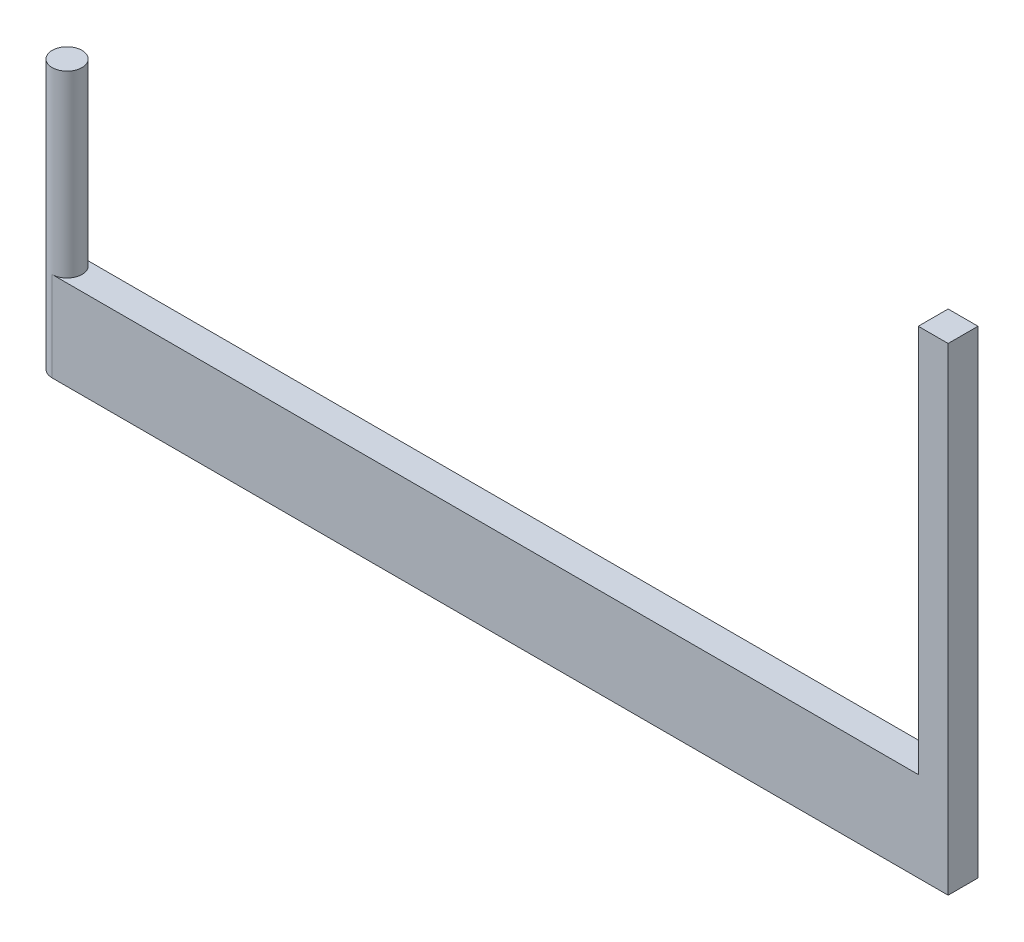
from build123d import *

# Parameters (mm, degrees)
SKETCH1_R           = 2.5
BOSS_EXTRUDE1_DEPTH = 45
BOSS_EXTRUDE2_DEPTH = 15
SKETCH3_W           = 5
SKETCH3_H           = 65
BOSS_EXTRUDE5_DEPTH = 5


with BuildPart() as part:
    # Sketch1 → Boss-Extrude1 (new body)
    with BuildSketch(Plane(origin=(0, 0, 0), x_dir=(1, 0, 0), z_dir=(0, 1, 0))):
        with Locations(Location((0, 0, 0), (0, 0, 90))):
            Circle(SKETCH1_R)
    extrude(amount=BOSS_EXTRUDE1_DEPTH)

    # Sketch1_3 → Boss-Extrude2 (add)
    with BuildSketch(Plane(origin=(0, 0, 0), x_dir=(1, 0, 0), z_dir=(0, 1, 0))):
        with BuildLine():
            Line((150, 2.5), (0, 2.5))
            ThreePointArc((0, 2.5), (1.767766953, 1.767766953), (2.5, 0))
            ThreePointArc((2.5, 0), (1.767766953, -1.767766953), (0, -2.5))
            Line((0, -2.5), (150, -2.5))
            Line((150, -2.5), (150, 2.5))
        make_face()
    extrude(amount=BOSS_EXTRUDE2_DEPTH)

    # Sketch3 → Boss-Extrude5 (add)
    with BuildSketch(Plane.XY.offset(2.5)):
        with Locations((147.5, 47.5)):
            Rectangle(SKETCH3_W, SKETCH3_H)
    extrude(amount=-BOSS_EXTRUDE5_DEPTH)


solid = part.part
